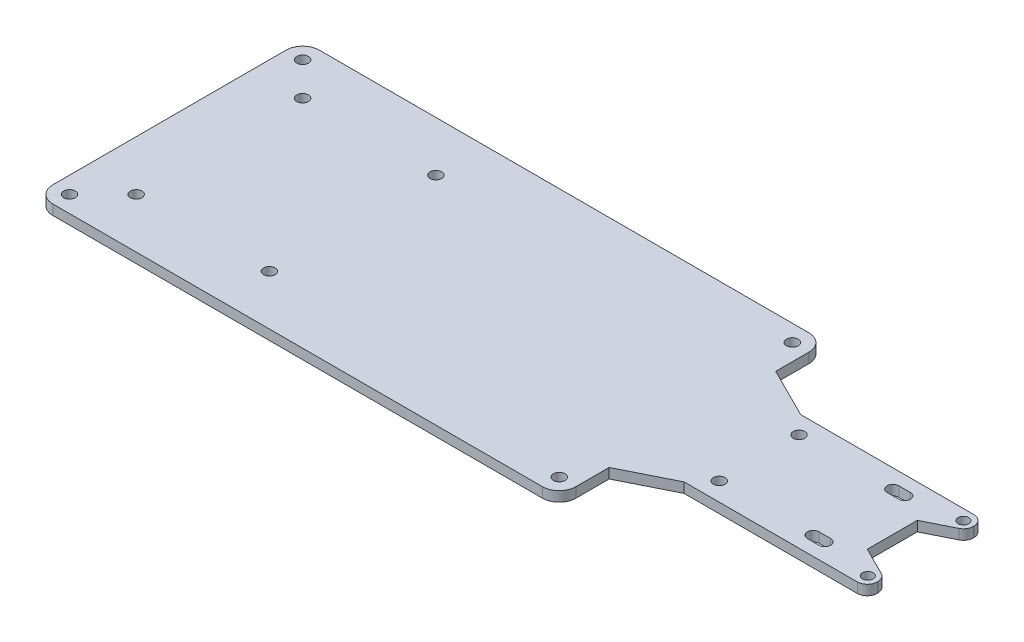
ISO-10303-21;
HEADER;
FILE_DESCRIPTION(('STEP AP214'),'2;1');
FILE_NAME('part.step','',(''),(''),'','','');
FILE_SCHEMA(('AUTOMOTIVE_DESIGN { 1 0 10303 214 1 1 1 1 }'));
ENDSEC;
DATA;
#1=APPLICATION_CONTEXT('core data for automotive mechanical design processes');
#2=APPLICATION_PROTOCOL_DEFINITION('international standard','automotive_design',2000,#1);
#3=PRODUCT_CONTEXT('',#1,'mechanical');
#4=PRODUCT('Part','Part','',(#3));
#5=PRODUCT_RELATED_PRODUCT_CATEGORY('part','',(#4));
#6=PRODUCT_DEFINITION_FORMATION('','',#4);
#7=PRODUCT_DEFINITION_CONTEXT('part definition',#1,'design');
#8=PRODUCT_DEFINITION('design','',#6,#7);
#9=PRODUCT_DEFINITION_SHAPE('','',#8);
#10=(LENGTH_UNIT() NAMED_UNIT(*) SI_UNIT(.MILLI.,.METRE.));
#11=(NAMED_UNIT(*) PLANE_ANGLE_UNIT() SI_UNIT($,.RADIAN.));
#12=(NAMED_UNIT(*) SI_UNIT($,.STERADIAN.) SOLID_ANGLE_UNIT());
#13=UNCERTAINTY_MEASURE_WITH_UNIT(LENGTH_MEASURE(1.E-05),#10,'distance_accuracy_value','');
#14=(GEOMETRIC_REPRESENTATION_CONTEXT(3) GLOBAL_UNCERTAINTY_ASSIGNED_CONTEXT((#13)) GLOBAL_UNIT_ASSIGNED_CONTEXT((#10,
#11,#12)) REPRESENTATION_CONTEXT('',''));
#15=CARTESIAN_POINT('',(0.,0.,0.));
#16=DIRECTION('',(0.,0.,1.));
#17=DIRECTION('',(1.,0.,0.));
#18=AXIS2_PLACEMENT_3D('',#15,#16,#17);
#19=CARTESIAN_POINT('',(224.,3.,-14.5));
#20=DIRECTION('',(0.,-1.,0.));
#21=DIRECTION('',(0.,0.,-1.));
#22=AXIS2_PLACEMENT_3D('',#19,#20,#21);
#23=PLANE('',#22);
#24=CARTESIAN_POINT('',(177.024019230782,3.,11.975));
#25=DIRECTION('',(0.,1.,0.));
#26=DIRECTION('',(0.,0.,1.));
#27=AXIS2_PLACEMENT_3D('',#24,#25,#26);
#28=CIRCLE('',#27,1.75000000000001);
#29=CARTESIAN_POINT('',(177.024019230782,3.,13.725));
#30=VERTEX_POINT('',#29);
#31=EDGE_CURVE('E269',#30,#30,#28,.T.);
#32=ORIENTED_EDGE('',*,*,#31,.F.);
#33=EDGE_LOOP('',(#32));
#34=FACE_BOUND('',#33,.T.);
#35=DIRECTION('',(1.,0.,0.));
#36=VECTOR('',#35,1.);
#37=CARTESIAN_POINT('',(205.225980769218,3.,-10.225));
#38=LINE('',#37,#36);
#39=CARTESIAN_POINT('',(205.225980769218,3.,-10.225));
#40=VERTEX_POINT('',#39);
#41=CARTESIAN_POINT('',(208.725980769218,3.,-10.225));
#42=VERTEX_POINT('',#41);
#43=EDGE_CURVE('E284',#40,#42,#38,.T.);
#44=ORIENTED_EDGE('',*,*,#43,.F.);
#45=CARTESIAN_POINT('',(205.225980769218,3.,-11.975));
#46=DIRECTION('',(0.,1.,0.));
#47=DIRECTION('',(0.,0.,1.));
#48=AXIS2_PLACEMENT_3D('',#45,#46,#47);
#49=CIRCLE('',#48,1.75);
#50=CARTESIAN_POINT('',(205.225980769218,3.,-13.725));
#51=VERTEX_POINT('',#50);
#52=EDGE_CURVE('E58',#51,#40,#49,.T.);
#53=ORIENTED_EDGE('',*,*,#52,.F.);
#54=DIRECTION('',(-1.,0.,0.));
#55=VECTOR('',#54,1.);
#56=CARTESIAN_POINT('',(205.225980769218,3.,-13.725));
#57=LINE('',#56,#55);
#58=CARTESIAN_POINT('',(208.725980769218,3.,-13.725));
#59=VERTEX_POINT('',#58);
#60=EDGE_CURVE('E275',#59,#51,#57,.T.);
#61=ORIENTED_EDGE('',*,*,#60,.F.);
#62=CARTESIAN_POINT('',(208.725980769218,3.,-11.975));
#63=DIRECTION('',(0.,1.,0.));
#64=DIRECTION('',(0.,0.,1.));
#65=AXIS2_PLACEMENT_3D('',#62,#63,#64);
#66=CIRCLE('',#65,1.75);
#67=EDGE_CURVE('E281',#42,#59,#66,.T.);
#68=ORIENTED_EDGE('',*,*,#67,.F.);
#69=EDGE_LOOP('',(#44,#53,#61,#68));
#70=FACE_BOUND('',#69,.T.);
#71=DIRECTION('',(1.,0.,0.));
#72=VECTOR('',#71,1.);
#73=CARTESIAN_POINT('',(205.225980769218,3.,13.725));
#74=LINE('',#73,#72);
#75=CARTESIAN_POINT('',(205.225980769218,3.,13.725));
#76=VERTEX_POINT('',#75);
#77=CARTESIAN_POINT('',(208.725980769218,3.,13.725));
#78=VERTEX_POINT('',#77);
#79=EDGE_CURVE('E261',#76,#78,#74,.T.);
#80=ORIENTED_EDGE('',*,*,#79,.F.);
#81=CARTESIAN_POINT('',(205.225980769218,3.,11.975));
#82=DIRECTION('',(0.,1.,0.));
#83=DIRECTION('',(0.,0.,1.));
#84=AXIS2_PLACEMENT_3D('',#81,#82,#83);
#85=CIRCLE('',#84,1.75);
#86=CARTESIAN_POINT('',(205.225980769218,3.,10.225));
#87=VERTEX_POINT('',#86);
#88=EDGE_CURVE('E66',#87,#76,#85,.T.);
#89=ORIENTED_EDGE('',*,*,#88,.F.);
#90=DIRECTION('',(-1.,0.,0.));
#91=VECTOR('',#90,1.);
#92=CARTESIAN_POINT('',(205.225980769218,3.,10.225));
#93=LINE('',#92,#91);
#94=CARTESIAN_POINT('',(208.725980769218,3.,10.225));
#95=VERTEX_POINT('',#94);
#96=EDGE_CURVE('E249',#95,#87,#93,.T.);
#97=ORIENTED_EDGE('',*,*,#96,.F.);
#98=CARTESIAN_POINT('',(208.725980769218,3.,11.975));
#99=DIRECTION('',(0.,1.,0.));
#100=DIRECTION('',(0.,0.,1.));
#101=AXIS2_PLACEMENT_3D('',#98,#99,#100);
#102=CIRCLE('',#101,1.75);
#103=EDGE_CURVE('E255',#78,#95,#102,.T.);
#104=ORIENTED_EDGE('',*,*,#103,.F.);
#105=EDGE_LOOP('',(#80,#89,#97,#104));
#106=FACE_BOUND('',#105,.T.);
#107=CARTESIAN_POINT('',(177.024019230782,3.,-11.975));
#108=DIRECTION('',(0.,1.,0.));
#109=DIRECTION('',(0.,0.,1.));
#110=AXIS2_PLACEMENT_3D('',#107,#108,#109);
#111=CIRCLE('',#110,1.75000000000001);
#112=CARTESIAN_POINT('',(177.024019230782,3.,-10.225));
#113=VERTEX_POINT('',#112);
#114=EDGE_CURVE('E272',#113,#113,#111,.T.);
#115=ORIENTED_EDGE('',*,*,#114,.F.);
#116=EDGE_LOOP('',(#115));
#117=FACE_BOUND('',#116,.T.);
#118=CARTESIAN_POINT('',(5.,3.,35.));
#119=DIRECTION('',(0.,1.,0.));
#120=DIRECTION('',(0.,0.,1.));
#121=AXIS2_PLACEMENT_3D('',#118,#119,#120);
#122=CIRCLE('',#121,1.75);
#123=CARTESIAN_POINT('',(5.,3.,36.75));
#124=VERTEX_POINT('',#123);
#125=EDGE_CURVE('E295',#124,#124,#122,.T.);
#126=ORIENTED_EDGE('',*,*,#125,.F.);
#127=EDGE_LOOP('',(#126));
#128=FACE_BOUND('',#127,.T.);
#129=CARTESIAN_POINT('',(152.,3.,-35.));
#130=DIRECTION('',(0.,1.,0.));
#131=DIRECTION('',(0.,0.,1.));
#132=AXIS2_PLACEMENT_3D('',#129,#130,#131);
#133=CIRCLE('',#132,1.75000000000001);
#134=CARTESIAN_POINT('',(152.,3.,-33.25));
#135=VERTEX_POINT('',#134);
#136=EDGE_CURVE('E294',#135,#135,#133,.T.);
#137=ORIENTED_EDGE('',*,*,#136,.F.);
#138=EDGE_LOOP('',(#137));
#139=FACE_BOUND('',#138,.T.);
#140=CARTESIAN_POINT('',(152.,3.,35.));
#141=DIRECTION('',(0.,1.,0.));
#142=DIRECTION('',(0.,0.,1.));
#143=AXIS2_PLACEMENT_3D('',#140,#141,#142);
#144=CIRCLE('',#143,1.75000000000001);
#145=CARTESIAN_POINT('',(152.,3.,36.75));
#146=VERTEX_POINT('',#145);
#147=EDGE_CURVE('E291',#146,#146,#144,.T.);
#148=ORIENTED_EDGE('',*,*,#147,.F.);
#149=EDGE_LOOP('',(#148));
#150=FACE_BOUND('',#149,.T.);
#151=CARTESIAN_POINT('',(5.,3.,-35.));
#152=DIRECTION('',(0.,1.,0.));
#153=DIRECTION('',(0.,0.,1.));
#154=AXIS2_PLACEMENT_3D('',#151,#152,#153);
#155=CIRCLE('',#154,1.75);
#156=CARTESIAN_POINT('',(5.,3.,-33.25));
#157=VERTEX_POINT('',#156);
#158=EDGE_CURVE('E298',#157,#157,#155,.T.);
#159=ORIENTED_EDGE('',*,*,#158,.F.);
#160=EDGE_LOOP('',(#159));
#161=FACE_BOUND('',#160,.T.);
#162=CARTESIAN_POINT('',(15.,3.,25.));
#163=DIRECTION('',(0.,-1.,0.));
#164=DIRECTION('',(0.,0.,-1.));
#165=AXIS2_PLACEMENT_3D('',#162,#163,#164);
#166=CIRCLE('',#165,1.75);
#167=CARTESIAN_POINT('',(15.,3.,23.25));
#168=VERTEX_POINT('',#167);
#169=EDGE_CURVE('E326',#168,#168,#166,.T.);
#170=ORIENTED_EDGE('',*,*,#169,.T.);
#171=EDGE_LOOP('',(#170));
#172=FACE_BOUND('',#171,.T.);
#173=CARTESIAN_POINT('',(55.,3.,25.));
#174=DIRECTION('',(0.,-1.,0.));
#175=DIRECTION('',(0.,0.,-1.));
#176=AXIS2_PLACEMENT_3D('',#173,#174,#175);
#177=CIRCLE('',#176,1.75);
#178=CARTESIAN_POINT('',(55.,3.,23.25));
#179=VERTEX_POINT('',#178);
#180=EDGE_CURVE('E323',#179,#179,#177,.T.);
#181=ORIENTED_EDGE('',*,*,#180,.T.);
#182=EDGE_LOOP('',(#181));
#183=FACE_BOUND('',#182,.T.);
#184=CARTESIAN_POINT('',(55.,3.,-25.));
#185=DIRECTION('',(0.,-1.,0.));
#186=DIRECTION('',(0.,0.,-1.));
#187=AXIS2_PLACEMENT_3D('',#184,#185,#186);
#188=CIRCLE('',#187,1.75);
#189=CARTESIAN_POINT('',(55.,3.,-26.75));
#190=VERTEX_POINT('',#189);
#191=EDGE_CURVE('E320',#190,#190,#188,.T.);
#192=ORIENTED_EDGE('',*,*,#191,.T.);
#193=EDGE_LOOP('',(#192));
#194=FACE_BOUND('',#193,.T.);
#195=CARTESIAN_POINT('',(15.,3.,-25.));
#196=DIRECTION('',(0.,-1.,0.));
#197=DIRECTION('',(0.,0.,-1.));
#198=AXIS2_PLACEMENT_3D('',#195,#196,#197);
#199=CIRCLE('',#198,1.75);
#200=CARTESIAN_POINT('',(15.,3.,-26.75));
#201=VERTEX_POINT('',#200);
#202=EDGE_CURVE('E317',#201,#201,#199,.T.);
#203=ORIENTED_EDGE('',*,*,#202,.T.);
#204=EDGE_LOOP('',(#203));
#205=FACE_BOUND('',#204,.T.);
#206=DIRECTION('',(1.,0.,0.));
#207=VECTOR('',#206,1.);
#208=CARTESIAN_POINT('',(0.,3.,40.));
#209=LINE('',#208,#207);
#210=CARTESIAN_POINT('',(5.,3.,40.));
#211=VERTEX_POINT('',#210);
#212=CARTESIAN_POINT('',(152.,3.,40.));
#213=VERTEX_POINT('',#212);
#214=EDGE_CURVE('E352',#211,#213,#209,.T.);
#215=ORIENTED_EDGE('',*,*,#214,.T.);
#216=CARTESIAN_POINT('',(152.,3.,35.));
#217=DIRECTION('',(0.,-1.,0.));
#218=DIRECTION('',(0.,0.,-1.));
#219=AXIS2_PLACEMENT_3D('',#216,#217,#218);
#220=CIRCLE('',#219,5.);
#221=CARTESIAN_POINT('',(157.,3.,35.));
#222=VERTEX_POINT('',#221);
#223=EDGE_CURVE('E485',#213,#222,#220,.F.);
#224=ORIENTED_EDGE('',*,*,#223,.T.);
#225=DIRECTION('',(0.,0.,-1.));
#226=VECTOR('',#225,1.);
#227=CARTESIAN_POINT('',(157.,3.,40.));
#228=LINE('',#227,#226);
#229=CARTESIAN_POINT('',(157.,3.,25.));
#230=VERTEX_POINT('',#229);
#231=EDGE_CURVE('E355',#222,#230,#228,.T.);
#232=ORIENTED_EDGE('',*,*,#231,.T.);
#233=DIRECTION('',(0.894427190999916,0.,-0.447213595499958));
#234=VECTOR('',#233,1.);
#235=CARTESIAN_POINT('',(157.,3.,25.));
#236=LINE('',#235,#234);
#237=CARTESIAN_POINT('',(172.,3.,17.5));
#238=VERTEX_POINT('',#237);
#239=EDGE_CURVE('E357',#230,#238,#236,.T.);
#240=ORIENTED_EDGE('',*,*,#239,.T.);
#241=DIRECTION('',(1.,0.,0.));
#242=VECTOR('',#241,1.);
#243=CARTESIAN_POINT('',(172.,3.,17.5));
#244=LINE('',#243,#242);
#245=CARTESIAN_POINT('',(224.,3.,17.5));
#246=VERTEX_POINT('',#245);
#247=EDGE_CURVE('E359',#238,#246,#244,.T.);
#248=ORIENTED_EDGE('',*,*,#247,.T.);
#249=CARTESIAN_POINT('',(224.,3.,14.5));
#250=DIRECTION('',(0.,1.,0.));
#251=DIRECTION('',(0.,0.,1.));
#252=AXIS2_PLACEMENT_3D('',#249,#250,#251);
#253=CIRCLE('',#252,3.);
#254=CARTESIAN_POINT('',(227.,3.,14.5));
#255=VERTEX_POINT('',#254);
#256=EDGE_CURVE('E361',#246,#255,#253,.T.);
#257=ORIENTED_EDGE('',*,*,#256,.T.);
#258=DIRECTION('',(0.,0.,-1.));
#259=VECTOR('',#258,1.);
#260=CARTESIAN_POINT('',(227.,3.,14.3541019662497));
#261=LINE('',#260,#259);
#262=CARTESIAN_POINT('',(227.,3.,14.3541019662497));
#263=VERTEX_POINT('',#262);
#264=EDGE_CURVE('E363',#255,#263,#261,.T.);
#265=ORIENTED_EDGE('',*,*,#264,.T.);
#266=CARTESIAN_POINT('',(224.,3.,14.3541019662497));
#267=DIRECTION('',(0.,1.,0.));
#268=DIRECTION('',(0.,0.,-1.));
#269=AXIS2_PLACEMENT_3D('',#266,#267,#268);
#270=CIRCLE('',#269,3.);
#271=CARTESIAN_POINT('',(225.3416407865,3.,11.6708203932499));
#272=VERTEX_POINT('',#271);
#273=EDGE_CURVE('E365',#263,#272,#270,.T.);
#274=ORIENTED_EDGE('',*,*,#273,.T.);
#275=DIRECTION('',(-0.894427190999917,0.,-0.447213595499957));
#276=VECTOR('',#275,1.);
#277=CARTESIAN_POINT('',(217.,3.,7.5));
#278=LINE('',#277,#276);
#279=CARTESIAN_POINT('',(217.,3.,7.5));
#280=VERTEX_POINT('',#279);
#281=EDGE_CURVE('E367',#272,#280,#278,.T.);
#282=ORIENTED_EDGE('',*,*,#281,.T.);
#283=DIRECTION('',(0.,0.,-1.));
#284=VECTOR('',#283,1.);
#285=CARTESIAN_POINT('',(217.,3.,-7.5));
#286=LINE('',#285,#284);
#287=CARTESIAN_POINT('',(217.,3.,-7.5));
#288=VERTEX_POINT('',#287);
#289=EDGE_CURVE('E369',#280,#288,#286,.T.);
#290=ORIENTED_EDGE('',*,*,#289,.T.);
#291=DIRECTION('',(0.894427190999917,0.,-0.447213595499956));
#292=VECTOR('',#291,1.);
#293=CARTESIAN_POINT('',(217.,3.,-7.5));
#294=LINE('',#293,#292);
#295=CARTESIAN_POINT('',(225.3416407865,3.,-11.6708203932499));
#296=VERTEX_POINT('',#295);
#297=EDGE_CURVE('E371',#288,#296,#294,.T.);
#298=ORIENTED_EDGE('',*,*,#297,.T.);
#299=CARTESIAN_POINT('',(224.,3.,-14.3541019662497));
#300=DIRECTION('',(0.,1.,0.));
#301=DIRECTION('',(0.,0.,1.));
#302=AXIS2_PLACEMENT_3D('',#299,#300,#301);
#303=CIRCLE('',#302,3.00000000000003);
#304=CARTESIAN_POINT('',(227.,3.,-14.3541019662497));
#305=VERTEX_POINT('',#304);
#306=EDGE_CURVE('E373',#296,#305,#303,.T.);
#307=ORIENTED_EDGE('',*,*,#306,.T.);
#308=DIRECTION('',(-3.80479090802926E-13,0.,-1.));
#309=VECTOR('',#308,1.);
#310=CARTESIAN_POINT('',(227.,3.,-14.3541019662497));
#311=LINE('',#310,#309);
#312=CARTESIAN_POINT('',(227.,3.,-14.5));
#313=VERTEX_POINT('',#312);
#314=EDGE_CURVE('E375',#305,#313,#311,.T.);
#315=ORIENTED_EDGE('',*,*,#314,.T.);
#316=CARTESIAN_POINT('',(224.,3.,-14.5));
#317=DIRECTION('',(0.,1.,0.));
#318=DIRECTION('',(0.,0.,-1.));
#319=AXIS2_PLACEMENT_3D('',#316,#317,#318);
#320=CIRCLE('',#319,3.);
#321=CARTESIAN_POINT('',(224.,3.,-17.5));
#322=VERTEX_POINT('',#321);
#323=EDGE_CURVE('E377',#313,#322,#320,.T.);
#324=ORIENTED_EDGE('',*,*,#323,.T.);
#325=DIRECTION('',(-1.,0.,0.));
#326=VECTOR('',#325,1.);
#327=CARTESIAN_POINT('',(172.,3.,-17.5));
#328=LINE('',#327,#326);
#329=CARTESIAN_POINT('',(172.,3.,-17.5));
#330=VERTEX_POINT('',#329);
#331=EDGE_CURVE('E379',#322,#330,#328,.T.);
#332=ORIENTED_EDGE('',*,*,#331,.T.);
#333=DIRECTION('',(-0.894427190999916,0.,-0.447213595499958));
#334=VECTOR('',#333,1.);
#335=CARTESIAN_POINT('',(157.,3.,-25.));
#336=LINE('',#335,#334);
#337=CARTESIAN_POINT('',(157.,3.,-25.));
#338=VERTEX_POINT('',#337);
#339=EDGE_CURVE('E381',#330,#338,#336,.T.);
#340=ORIENTED_EDGE('',*,*,#339,.T.);
#341=DIRECTION('',(0.,0.,-1.));
#342=VECTOR('',#341,1.);
#343=CARTESIAN_POINT('',(157.,3.,-40.));
#344=LINE('',#343,#342);
#345=CARTESIAN_POINT('',(157.,3.,-35.));
#346=VERTEX_POINT('',#345);
#347=EDGE_CURVE('E342',#338,#346,#344,.T.);
#348=ORIENTED_EDGE('',*,*,#347,.T.);
#349=CARTESIAN_POINT('',(152.,3.,-35.));
#350=DIRECTION('',(0.,-1.,0.));
#351=DIRECTION('',(0.,0.,-1.));
#352=AXIS2_PLACEMENT_3D('',#349,#350,#351);
#353=CIRCLE('',#352,5.);
#354=CARTESIAN_POINT('',(152.,3.,-40.));
#355=VERTEX_POINT('',#354);
#356=EDGE_CURVE('E483',#346,#355,#353,.F.);
#357=ORIENTED_EDGE('',*,*,#356,.T.);
#358=DIRECTION('',(-1.,0.,0.));
#359=VECTOR('',#358,1.);
#360=CARTESIAN_POINT('',(77.,3.,-40.));
#361=LINE('',#360,#359);
#362=CARTESIAN_POINT('',(5.,3.,-40.));
#363=VERTEX_POINT('',#362);
#364=EDGE_CURVE('E345',#355,#363,#361,.T.);
#365=ORIENTED_EDGE('',*,*,#364,.T.);
#366=CARTESIAN_POINT('',(5.,3.,-35.));
#367=DIRECTION('',(0.,-1.,0.));
#368=DIRECTION('',(0.,0.,-1.));
#369=AXIS2_PLACEMENT_3D('',#366,#367,#368);
#370=CIRCLE('',#369,5.);
#371=CARTESIAN_POINT('',(0.,3.,-35.));
#372=VERTEX_POINT('',#371);
#373=EDGE_CURVE('E479',#363,#372,#370,.F.);
#374=ORIENTED_EDGE('',*,*,#373,.T.);
#375=DIRECTION('',(0.,0.,1.));
#376=VECTOR('',#375,1.);
#377=CARTESIAN_POINT('',(0.,3.,-40.));
#378=LINE('',#377,#376);
#379=CARTESIAN_POINT('',(0.,3.,35.));
#380=VERTEX_POINT('',#379);
#381=EDGE_CURVE('E349',#372,#380,#378,.T.);
#382=ORIENTED_EDGE('',*,*,#381,.T.);
#383=CARTESIAN_POINT('',(5.,3.,35.));
#384=DIRECTION('',(0.,-1.,0.));
#385=DIRECTION('',(0.,0.,-1.));
#386=AXIS2_PLACEMENT_3D('',#383,#384,#385);
#387=CIRCLE('',#386,5.);
#388=EDGE_CURVE('E481',#380,#211,#387,.F.);
#389=ORIENTED_EDGE('',*,*,#388,.T.);
#390=EDGE_LOOP('',(#215,#224,#232,#240,#248,#257,#265,#274,#282,#290,#298,#307,#315,#324,#332,
#340,#348,#357,#365,#374,#382,#389));
#391=FACE_BOUND('',#390,.T.);
#392=CARTESIAN_POINT('',(224.,3.,-14.3541019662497));
#393=DIRECTION('',(0.,1.,0.));
#394=DIRECTION('',(0.,0.,1.));
#395=AXIS2_PLACEMENT_3D('',#392,#393,#394);
#396=CIRCLE('',#395,1.59999999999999);
#397=CARTESIAN_POINT('',(224.,3.,-12.7541019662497));
#398=VERTEX_POINT('',#397);
#399=EDGE_CURVE('E336',#398,#398,#396,.T.);
#400=ORIENTED_EDGE('',*,*,#399,.F.);
#401=EDGE_LOOP('',(#400));
#402=FACE_BOUND('',#401,.T.);
#403=CARTESIAN_POINT('',(224.,3.,14.3541019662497));
#404=DIRECTION('',(0.,1.,0.));
#405=DIRECTION('',(0.,0.,-1.));
#406=AXIS2_PLACEMENT_3D('',#403,#404,#405);
#407=CIRCLE('',#406,1.59999999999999);
#408=CARTESIAN_POINT('',(224.,3.,12.7541019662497));
#409=VERTEX_POINT('',#408);
#410=EDGE_CURVE('E330',#409,#409,#407,.T.);
#411=ORIENTED_EDGE('',*,*,#410,.F.);
#412=EDGE_LOOP('',(#411));
#413=FACE_BOUND('',#412,.T.);
#414=ADVANCED_FACE('F42',(#34,#70,#106,#117,#128,#139,#150,#161,#172,#183,#194,#205,#391,#402,
#413),#23,.F.);
#415=CARTESIAN_POINT('',(224.,0.,-14.5));
#416=DIRECTION('',(0.,-1.,0.));
#417=DIRECTION('',(0.,0.,-1.));
#418=AXIS2_PLACEMENT_3D('',#415,#416,#417);
#419=PLANE('',#418);
#420=CARTESIAN_POINT('',(177.024019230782,0.,11.975));
#421=DIRECTION('',(0.,-1.,0.));
#422=DIRECTION('',(0.,0.,-1.));
#423=AXIS2_PLACEMENT_3D('',#420,#421,#422);
#424=CIRCLE('',#423,1.75000000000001);
#425=CARTESIAN_POINT('',(177.024019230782,0.,10.225));
#426=VERTEX_POINT('',#425);
#427=EDGE_CURVE('E46',#426,#426,#424,.T.);
#428=ORIENTED_EDGE('',*,*,#427,.F.);
#429=EDGE_LOOP('',(#428));
#430=FACE_BOUND('',#429,.T.);
#431=CARTESIAN_POINT('',(205.225980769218,0.,-11.975));
#432=DIRECTION('',(0.,-1.,0.));
#433=DIRECTION('',(0.,0.,-1.));
#434=AXIS2_PLACEMENT_3D('',#431,#432,#433);
#435=CIRCLE('',#434,1.75);
#436=CARTESIAN_POINT('',(205.225980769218,0.,-10.225));
#437=VERTEX_POINT('',#436);
#438=CARTESIAN_POINT('',(205.225980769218,0.,-13.725));
#439=VERTEX_POINT('',#438);
#440=EDGE_CURVE('E11',#437,#439,#435,.T.);
#441=ORIENTED_EDGE('',*,*,#440,.F.);
#442=DIRECTION('',(-1.,0.,0.));
#443=VECTOR('',#442,1.);
#444=CARTESIAN_POINT('',(224.,0.,-10.225));
#445=LINE('',#444,#443);
#446=CARTESIAN_POINT('',(208.725980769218,0.,-10.225));
#447=VERTEX_POINT('',#446);
#448=EDGE_CURVE('E519',#447,#437,#445,.T.);
#449=ORIENTED_EDGE('',*,*,#448,.F.);
#450=CARTESIAN_POINT('',(208.725980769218,0.,-11.975));
#451=DIRECTION('',(0.,-1.,0.));
#452=DIRECTION('',(0.,0.,-1.));
#453=AXIS2_PLACEMENT_3D('',#450,#451,#452);
#454=CIRCLE('',#453,1.75);
#455=CARTESIAN_POINT('',(208.725980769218,0.,-13.725));
#456=VERTEX_POINT('',#455);
#457=EDGE_CURVE('E521',#456,#447,#454,.T.);
#458=ORIENTED_EDGE('',*,*,#457,.F.);
#459=DIRECTION('',(1.,0.,0.));
#460=VECTOR('',#459,1.);
#461=CARTESIAN_POINT('',(224.,0.,-13.725));
#462=LINE('',#461,#460);
#463=EDGE_CURVE('E51',#439,#456,#462,.T.);
#464=ORIENTED_EDGE('',*,*,#463,.F.);
#465=EDGE_LOOP('',(#441,#449,#458,#464));
#466=FACE_BOUND('',#465,.T.);
#467=CARTESIAN_POINT('',(205.225980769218,0.,11.975));
#468=DIRECTION('',(0.,-1.,0.));
#469=DIRECTION('',(0.,0.,-1.));
#470=AXIS2_PLACEMENT_3D('',#467,#468,#469);
#471=CIRCLE('',#470,1.75);
#472=CARTESIAN_POINT('',(205.225980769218,0.,13.725));
#473=VERTEX_POINT('',#472);
#474=CARTESIAN_POINT('',(205.225980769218,0.,10.225));
#475=VERTEX_POINT('',#474);
#476=EDGE_CURVE('E243',#473,#475,#471,.T.);
#477=ORIENTED_EDGE('',*,*,#476,.F.);
#478=DIRECTION('',(-1.,0.,0.));
#479=VECTOR('',#478,1.);
#480=CARTESIAN_POINT('',(224.,0.,13.725));
#481=LINE('',#480,#479);
#482=CARTESIAN_POINT('',(208.725980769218,0.,13.725));
#483=VERTEX_POINT('',#482);
#484=EDGE_CURVE('E499',#483,#473,#481,.T.);
#485=ORIENTED_EDGE('',*,*,#484,.F.);
#486=CARTESIAN_POINT('',(208.725980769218,0.,11.975));
#487=DIRECTION('',(0.,-1.,0.));
#488=DIRECTION('',(0.,0.,-1.));
#489=AXIS2_PLACEMENT_3D('',#486,#487,#488);
#490=CIRCLE('',#489,1.75);
#491=CARTESIAN_POINT('',(208.725980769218,0.,10.225));
#492=VERTEX_POINT('',#491);
#493=EDGE_CURVE('E513',#492,#483,#490,.T.);
#494=ORIENTED_EDGE('',*,*,#493,.F.);
#495=DIRECTION('',(1.,0.,0.));
#496=VECTOR('',#495,1.);
#497=CARTESIAN_POINT('',(224.,0.,10.225));
#498=LINE('',#497,#496);
#499=EDGE_CURVE('E516',#475,#492,#498,.T.);
#500=ORIENTED_EDGE('',*,*,#499,.F.);
#501=EDGE_LOOP('',(#477,#485,#494,#500));
#502=FACE_BOUND('',#501,.T.);
#503=CARTESIAN_POINT('',(177.024019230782,0.,-11.975));
#504=DIRECTION('',(0.,-1.,0.));
#505=DIRECTION('',(0.,0.,-1.));
#506=AXIS2_PLACEMENT_3D('',#503,#504,#505);
#507=CIRCLE('',#506,1.75000000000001);
#508=CARTESIAN_POINT('',(177.024019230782,0.,-13.725));
#509=VERTEX_POINT('',#508);
#510=EDGE_CURVE('E290',#509,#509,#507,.T.);
#511=ORIENTED_EDGE('',*,*,#510,.F.);
#512=EDGE_LOOP('',(#511));
#513=FACE_BOUND('',#512,.T.);
#514=CARTESIAN_POINT('',(5.,0.,35.));
#515=DIRECTION('',(0.,-1.,0.));
#516=DIRECTION('',(0.,0.,-1.));
#517=AXIS2_PLACEMENT_3D('',#514,#515,#516);
#518=CIRCLE('',#517,1.75);
#519=CARTESIAN_POINT('',(5.,0.,33.25));
#520=VERTEX_POINT('',#519);
#521=EDGE_CURVE('E314',#520,#520,#518,.T.);
#522=ORIENTED_EDGE('',*,*,#521,.F.);
#523=EDGE_LOOP('',(#522));
#524=FACE_BOUND('',#523,.T.);
#525=CARTESIAN_POINT('',(152.,0.,-35.));
#526=DIRECTION('',(0.,-1.,0.));
#527=DIRECTION('',(0.,0.,-1.));
#528=AXIS2_PLACEMENT_3D('',#525,#526,#527);
#529=CIRCLE('',#528,1.75000000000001);
#530=CARTESIAN_POINT('',(152.,0.,-36.75));
#531=VERTEX_POINT('',#530);
#532=EDGE_CURVE('E505',#531,#531,#529,.T.);
#533=ORIENTED_EDGE('',*,*,#532,.F.);
#534=EDGE_LOOP('',(#533));
#535=FACE_BOUND('',#534,.T.);
#536=CARTESIAN_POINT('',(152.,0.,35.));
#537=DIRECTION('',(0.,-1.,0.));
#538=DIRECTION('',(0.,0.,-1.));
#539=AXIS2_PLACEMENT_3D('',#536,#537,#538);
#540=CIRCLE('',#539,1.75000000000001);
#541=CARTESIAN_POINT('',(152.,0.,33.25));
#542=VERTEX_POINT('',#541);
#543=EDGE_CURVE('E502',#542,#542,#540,.T.);
#544=ORIENTED_EDGE('',*,*,#543,.F.);
#545=EDGE_LOOP('',(#544));
#546=FACE_BOUND('',#545,.T.);
#547=CARTESIAN_POINT('',(5.,0.,-35.));
#548=DIRECTION('',(0.,-1.,0.));
#549=DIRECTION('',(0.,0.,-1.));
#550=AXIS2_PLACEMENT_3D('',#547,#548,#549);
#551=CIRCLE('',#550,1.75);
#552=CARTESIAN_POINT('',(5.,0.,-36.75));
#553=VERTEX_POINT('',#552);
#554=EDGE_CURVE('E303',#553,#553,#551,.T.);
#555=ORIENTED_EDGE('',*,*,#554,.F.);
#556=EDGE_LOOP('',(#555));
#557=FACE_BOUND('',#556,.T.);
#558=CARTESIAN_POINT('',(15.,0.,25.));
#559=DIRECTION('',(0.,1.,0.));
#560=DIRECTION('',(0.,0.,1.));
#561=AXIS2_PLACEMENT_3D('',#558,#559,#560);
#562=CIRCLE('',#561,1.75);
#563=CARTESIAN_POINT('',(15.,0.,26.75));
#564=VERTEX_POINT('',#563);
#565=EDGE_CURVE('E311',#564,#564,#562,.T.);
#566=ORIENTED_EDGE('',*,*,#565,.T.);
#567=EDGE_LOOP('',(#566));
#568=FACE_BOUND('',#567,.T.);
#569=CARTESIAN_POINT('',(55.,0.,25.));
#570=DIRECTION('',(0.,1.,0.));
#571=DIRECTION('',(0.,0.,1.));
#572=AXIS2_PLACEMENT_3D('',#569,#570,#571);
#573=CIRCLE('',#572,1.75);
#574=CARTESIAN_POINT('',(55.,0.,26.75));
#575=VERTEX_POINT('',#574);
#576=EDGE_CURVE('E308',#575,#575,#573,.T.);
#577=ORIENTED_EDGE('',*,*,#576,.T.);
#578=EDGE_LOOP('',(#577));
#579=FACE_BOUND('',#578,.T.);
#580=CARTESIAN_POINT('',(55.,0.,-25.));
#581=DIRECTION('',(0.,1.,0.));
#582=DIRECTION('',(0.,0.,1.));
#583=AXIS2_PLACEMENT_3D('',#580,#581,#582);
#584=CIRCLE('',#583,1.75);
#585=CARTESIAN_POINT('',(55.,0.,-23.25));
#586=VERTEX_POINT('',#585);
#587=EDGE_CURVE('E304',#586,#586,#584,.T.);
#588=ORIENTED_EDGE('',*,*,#587,.T.);
#589=EDGE_LOOP('',(#588));
#590=FACE_BOUND('',#589,.T.);
#591=CARTESIAN_POINT('',(15.,0.,-25.));
#592=DIRECTION('',(0.,1.,0.));
#593=DIRECTION('',(0.,0.,1.));
#594=AXIS2_PLACEMENT_3D('',#591,#592,#593);
#595=CIRCLE('',#594,1.75);
#596=CARTESIAN_POINT('',(15.,0.,-23.25));
#597=VERTEX_POINT('',#596);
#598=EDGE_CURVE('E307',#597,#597,#595,.T.);
#599=ORIENTED_EDGE('',*,*,#598,.T.);
#600=EDGE_LOOP('',(#599));
#601=FACE_BOUND('',#600,.T.);
#602=CARTESIAN_POINT('',(224.,0.,-14.3541019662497));
#603=DIRECTION('',(0.,1.,0.));
#604=DIRECTION('',(0.,0.,1.));
#605=AXIS2_PLACEMENT_3D('',#602,#603,#604);
#606=CIRCLE('',#605,1.59999999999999);
#607=CARTESIAN_POINT('',(224.,0.,-12.7541019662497));
#608=VERTEX_POINT('',#607);
#609=EDGE_CURVE('E333',#608,#608,#606,.T.);
#610=ORIENTED_EDGE('',*,*,#609,.T.);
#611=EDGE_LOOP('',(#610));
#612=FACE_BOUND('',#611,.T.);
#613=DIRECTION('',(0.,0.,-1.));
#614=VECTOR('',#613,1.);
#615=CARTESIAN_POINT('',(157.,0.,40.));
#616=LINE('',#615,#614);
#617=CARTESIAN_POINT('',(157.,0.,35.));
#618=VERTEX_POINT('',#617);
#619=CARTESIAN_POINT('',(157.,0.,25.));
#620=VERTEX_POINT('',#619);
#621=EDGE_CURVE('E395',#618,#620,#616,.T.);
#622=ORIENTED_EDGE('',*,*,#621,.F.);
#623=CARTESIAN_POINT('',(152.,0.,35.));
#624=DIRECTION('',(0.,-1.,0.));
#625=DIRECTION('',(0.,0.,-1.));
#626=AXIS2_PLACEMENT_3D('',#623,#624,#625);
#627=CIRCLE('',#626,5.);
#628=CARTESIAN_POINT('',(152.,0.,40.));
#629=VERTEX_POINT('',#628);
#630=EDGE_CURVE('E472',#618,#629,#627,.T.);
#631=ORIENTED_EDGE('',*,*,#630,.T.);
#632=DIRECTION('',(1.,0.,0.));
#633=VECTOR('',#632,1.);
#634=CARTESIAN_POINT('',(77.,0.,40.));
#635=LINE('',#634,#633);
#636=CARTESIAN_POINT('',(5.,0.,40.));
#637=VERTEX_POINT('',#636);
#638=EDGE_CURVE('E392',#637,#629,#635,.T.);
#639=ORIENTED_EDGE('',*,*,#638,.F.);
#640=CARTESIAN_POINT('',(5.,0.,35.));
#641=DIRECTION('',(0.,-1.,0.));
#642=DIRECTION('',(0.,0.,-1.));
#643=AXIS2_PLACEMENT_3D('',#640,#641,#642);
#644=CIRCLE('',#643,5.);
#645=CARTESIAN_POINT('',(0.,0.,35.));
#646=VERTEX_POINT('',#645);
#647=EDGE_CURVE('E468',#637,#646,#644,.T.);
#648=ORIENTED_EDGE('',*,*,#647,.T.);
#649=DIRECTION('',(0.,0.,1.));
#650=VECTOR('',#649,1.);
#651=CARTESIAN_POINT('',(0.,0.,30.));
#652=LINE('',#651,#650);
#653=CARTESIAN_POINT('',(0.,0.,-35.));
#654=VERTEX_POINT('',#653);
#655=EDGE_CURVE('E389',#654,#646,#652,.T.);
#656=ORIENTED_EDGE('',*,*,#655,.F.);
#657=CARTESIAN_POINT('',(5.,0.,-35.));
#658=DIRECTION('',(0.,-1.,0.));
#659=DIRECTION('',(0.,0.,-1.));
#660=AXIS2_PLACEMENT_3D('',#657,#658,#659);
#661=CIRCLE('',#660,5.);
#662=CARTESIAN_POINT('',(5.,0.,-40.));
#663=VERTEX_POINT('',#662);
#664=EDGE_CURVE('E466',#654,#663,#661,.T.);
#665=ORIENTED_EDGE('',*,*,#664,.T.);
#666=DIRECTION('',(-1.,0.,0.));
#667=VECTOR('',#666,1.);
#668=CARTESIAN_POINT('',(77.,0.,-40.));
#669=LINE('',#668,#667);
#670=CARTESIAN_POINT('',(152.,0.,-40.));
#671=VERTEX_POINT('',#670);
#672=EDGE_CURVE('E386',#671,#663,#669,.T.);
#673=ORIENTED_EDGE('',*,*,#672,.F.);
#674=CARTESIAN_POINT('',(152.,0.,-35.));
#675=DIRECTION('',(0.,-1.,0.));
#676=DIRECTION('',(0.,0.,-1.));
#677=AXIS2_PLACEMENT_3D('',#674,#675,#676);
#678=CIRCLE('',#677,5.);
#679=CARTESIAN_POINT('',(157.,0.,-35.));
#680=VERTEX_POINT('',#679);
#681=EDGE_CURVE('E470',#671,#680,#678,.T.);
#682=ORIENTED_EDGE('',*,*,#681,.T.);
#683=DIRECTION('',(0.,0.,-1.));
#684=VECTOR('',#683,1.);
#685=CARTESIAN_POINT('',(157.,0.,-40.));
#686=LINE('',#685,#684);
#687=CARTESIAN_POINT('',(157.,0.,-25.));
#688=VERTEX_POINT('',#687);
#689=EDGE_CURVE('E339',#688,#680,#686,.T.);
#690=ORIENTED_EDGE('',*,*,#689,.F.);
#691=DIRECTION('',(-0.894427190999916,0.,-0.447213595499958));
#692=VECTOR('',#691,1.);
#693=CARTESIAN_POINT('',(157.,0.,-25.));
#694=LINE('',#693,#692);
#695=CARTESIAN_POINT('',(172.,0.,-17.5));
#696=VERTEX_POINT('',#695);
#697=EDGE_CURVE('E346',#696,#688,#694,.T.);
#698=ORIENTED_EDGE('',*,*,#697,.F.);
#699=DIRECTION('',(-1.,0.,0.));
#700=VECTOR('',#699,1.);
#701=CARTESIAN_POINT('',(172.,0.,-17.5));
#702=LINE('',#701,#700);
#703=CARTESIAN_POINT('',(224.,0.,-17.5));
#704=VERTEX_POINT('',#703);
#705=EDGE_CURVE('E419',#704,#696,#702,.T.);
#706=ORIENTED_EDGE('',*,*,#705,.F.);
#707=CARTESIAN_POINT('',(224.,0.,-14.5));
#708=DIRECTION('',(0.,1.,0.));
#709=DIRECTION('',(0.,0.,-1.));
#710=AXIS2_PLACEMENT_3D('',#707,#708,#709);
#711=CIRCLE('',#710,3.);
#712=CARTESIAN_POINT('',(227.,0.,-14.5));
#713=VERTEX_POINT('',#712);
#714=EDGE_CURVE('E417',#713,#704,#711,.T.);
#715=ORIENTED_EDGE('',*,*,#714,.F.);
#716=DIRECTION('',(-3.80479090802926E-13,0.,-1.));
#717=VECTOR('',#716,1.);
#718=CARTESIAN_POINT('',(227.,0.,-14.3541019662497));
#719=LINE('',#718,#717);
#720=CARTESIAN_POINT('',(227.,0.,-14.3541019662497));
#721=VERTEX_POINT('',#720);
#722=EDGE_CURVE('E415',#721,#713,#719,.T.);
#723=ORIENTED_EDGE('',*,*,#722,.F.);
#724=CARTESIAN_POINT('',(224.,0.,-14.3541019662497));
#725=DIRECTION('',(0.,1.,0.));
#726=DIRECTION('',(0.,0.,1.));
#727=AXIS2_PLACEMENT_3D('',#724,#725,#726);
#728=CIRCLE('',#727,3.00000000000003);
#729=CARTESIAN_POINT('',(225.3416407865,0.,-11.6708203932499));
#730=VERTEX_POINT('',#729);
#731=EDGE_CURVE('E413',#730,#721,#728,.T.);
#732=ORIENTED_EDGE('',*,*,#731,.F.);
#733=DIRECTION('',(0.894427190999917,0.,-0.447213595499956));
#734=VECTOR('',#733,1.);
#735=CARTESIAN_POINT('',(217.,0.,-7.5));
#736=LINE('',#735,#734);
#737=CARTESIAN_POINT('',(217.,0.,-7.5));
#738=VERTEX_POINT('',#737);
#739=EDGE_CURVE('E411',#738,#730,#736,.T.);
#740=ORIENTED_EDGE('',*,*,#739,.F.);
#741=DIRECTION('',(0.,0.,-1.));
#742=VECTOR('',#741,1.);
#743=CARTESIAN_POINT('',(217.,0.,-7.5));
#744=LINE('',#743,#742);
#745=CARTESIAN_POINT('',(217.,0.,7.5));
#746=VERTEX_POINT('',#745);
#747=EDGE_CURVE('E409',#746,#738,#744,.T.);
#748=ORIENTED_EDGE('',*,*,#747,.F.);
#749=DIRECTION('',(-0.894427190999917,0.,-0.447213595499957));
#750=VECTOR('',#749,1.);
#751=CARTESIAN_POINT('',(217.,0.,7.5));
#752=LINE('',#751,#750);
#753=CARTESIAN_POINT('',(225.3416407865,0.,11.6708203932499));
#754=VERTEX_POINT('',#753);
#755=EDGE_CURVE('E407',#754,#746,#752,.T.);
#756=ORIENTED_EDGE('',*,*,#755,.F.);
#757=CARTESIAN_POINT('',(224.,0.,14.3541019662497));
#758=DIRECTION('',(0.,1.,0.));
#759=DIRECTION('',(0.,0.,-1.));
#760=AXIS2_PLACEMENT_3D('',#757,#758,#759);
#761=CIRCLE('',#760,3.);
#762=CARTESIAN_POINT('',(227.,0.,14.3541019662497));
#763=VERTEX_POINT('',#762);
#764=EDGE_CURVE('E405',#763,#754,#761,.T.);
#765=ORIENTED_EDGE('',*,*,#764,.F.);
#766=DIRECTION('',(0.,0.,-1.));
#767=VECTOR('',#766,1.);
#768=CARTESIAN_POINT('',(227.,0.,14.3541019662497));
#769=LINE('',#768,#767);
#770=CARTESIAN_POINT('',(227.,0.,14.5));
#771=VERTEX_POINT('',#770);
#772=EDGE_CURVE('E403',#771,#763,#769,.T.);
#773=ORIENTED_EDGE('',*,*,#772,.F.);
#774=CARTESIAN_POINT('',(224.,0.,14.5));
#775=DIRECTION('',(0.,1.,0.));
#776=DIRECTION('',(0.,0.,1.));
#777=AXIS2_PLACEMENT_3D('',#774,#775,#776);
#778=CIRCLE('',#777,3.);
#779=CARTESIAN_POINT('',(224.,0.,17.5));
#780=VERTEX_POINT('',#779);
#781=EDGE_CURVE('E401',#780,#771,#778,.T.);
#782=ORIENTED_EDGE('',*,*,#781,.F.);
#783=DIRECTION('',(1.,0.,0.));
#784=VECTOR('',#783,1.);
#785=CARTESIAN_POINT('',(172.,0.,17.5));
#786=LINE('',#785,#784);
#787=CARTESIAN_POINT('',(172.,0.,17.5));
#788=VERTEX_POINT('',#787);
#789=EDGE_CURVE('E399',#788,#780,#786,.T.);
#790=ORIENTED_EDGE('',*,*,#789,.F.);
#791=DIRECTION('',(0.894427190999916,0.,-0.447213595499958));
#792=VECTOR('',#791,1.);
#793=CARTESIAN_POINT('',(157.,0.,25.));
#794=LINE('',#793,#792);
#795=EDGE_CURVE('E397',#620,#788,#794,.T.);
#796=ORIENTED_EDGE('',*,*,#795,.F.);
#797=EDGE_LOOP('',(#622,#631,#639,#648,#656,#665,#673,#682,#690,#698,#706,#715,#723,#732,#740,
#748,#756,#765,#773,#782,#790,#796));
#798=FACE_BOUND('',#797,.T.);
#799=CARTESIAN_POINT('',(224.,0.,14.3541019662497));
#800=DIRECTION('',(0.,1.,0.));
#801=DIRECTION('',(0.,0.,-1.));
#802=AXIS2_PLACEMENT_3D('',#799,#800,#801);
#803=CIRCLE('',#802,1.59999999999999);
#804=CARTESIAN_POINT('',(224.,0.,12.7541019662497));
#805=VERTEX_POINT('',#804);
#806=EDGE_CURVE('E329',#805,#805,#803,.T.);
#807=ORIENTED_EDGE('',*,*,#806,.T.);
#808=EDGE_LOOP('',(#807));
#809=FACE_BOUND('',#808,.T.);
#810=ADVANCED_FACE('F537',(#430,#466,#502,#513,#524,#535,#546,#557,#568,#579,#590,#601,#612,
#798,#809),#419,.T.);
#811=CARTESIAN_POINT('',(157.,3.,-40.));
#812=DIRECTION('',(-1.,0.,0.));
#813=DIRECTION('',(0.,0.,1.));
#814=AXIS2_PLACEMENT_3D('',#811,#812,#813);
#815=PLANE('',#814);
#816=ORIENTED_EDGE('',*,*,#689,.T.);
#817=DIRECTION('',(0.,-1.,0.));
#818=VECTOR('',#817,1.);
#819=CARTESIAN_POINT('',(157.,3.,-35.));
#820=LINE('',#819,#818);
#821=EDGE_CURVE('E492',#680,#346,#820,.F.);
#822=ORIENTED_EDGE('',*,*,#821,.T.);
#823=ORIENTED_EDGE('',*,*,#347,.F.);
#824=DIRECTION('',(0.,-1.,0.));
#825=VECTOR('',#824,1.);
#826=CARTESIAN_POINT('',(157.,3.,-25.));
#827=LINE('',#826,#825);
#828=EDGE_CURVE('E383',#338,#688,#827,.T.);
#829=ORIENTED_EDGE('',*,*,#828,.T.);
#830=EDGE_LOOP('',(#816,#822,#823,#829));
#831=FACE_BOUND('',#830,.T.);
#832=ADVANCED_FACE('F551',(#831),#815,.F.);
#833=CARTESIAN_POINT('',(77.,3.,-40.));
#834=DIRECTION('',(0.,0.,1.));
#835=DIRECTION('',(1.,0.,0.));
#836=AXIS2_PLACEMENT_3D('',#833,#834,#835);
#837=PLANE('',#836);
#838=ORIENTED_EDGE('',*,*,#364,.F.);
#839=DIRECTION('',(0.,-1.,0.));
#840=VECTOR('',#839,1.);
#841=CARTESIAN_POINT('',(152.,3.,-40.));
#842=LINE('',#841,#840);
#843=EDGE_CURVE('E489',#355,#671,#842,.T.);
#844=ORIENTED_EDGE('',*,*,#843,.T.);
#845=ORIENTED_EDGE('',*,*,#672,.T.);
#846=DIRECTION('',(0.,-1.,0.));
#847=VECTOR('',#846,1.);
#848=CARTESIAN_POINT('',(5.,3.,-40.));
#849=LINE('',#848,#847);
#850=EDGE_CURVE('E487',#663,#363,#849,.F.);
#851=ORIENTED_EDGE('',*,*,#850,.T.);
#852=EDGE_LOOP('',(#838,#844,#845,#851));
#853=FACE_BOUND('',#852,.T.);
#854=ADVANCED_FACE('F622',(#853),#837,.F.);
#855=CARTESIAN_POINT('',(0.,3.,30.));
#856=DIRECTION('',(1.,0.,0.));
#857=DIRECTION('',(0.,0.,-1.));
#858=AXIS2_PLACEMENT_3D('',#855,#856,#857);
#859=PLANE('',#858);
#860=ORIENTED_EDGE('',*,*,#655,.T.);
#861=DIRECTION('',(0.,-1.,0.));
#862=VECTOR('',#861,1.);
#863=CARTESIAN_POINT('',(0.,3.,35.));
#864=LINE('',#863,#862);
#865=EDGE_CURVE('E497',#646,#380,#864,.F.);
#866=ORIENTED_EDGE('',*,*,#865,.T.);
#867=ORIENTED_EDGE('',*,*,#381,.F.);
#868=DIRECTION('',(0.,-1.,0.));
#869=VECTOR('',#868,1.);
#870=CARTESIAN_POINT('',(0.,3.,-35.));
#871=LINE('',#870,#869);
#872=EDGE_CURVE('E494',#372,#654,#871,.T.);
#873=ORIENTED_EDGE('',*,*,#872,.T.);
#874=EDGE_LOOP('',(#860,#866,#867,#873));
#875=FACE_BOUND('',#874,.T.);
#876=ADVANCED_FACE('F618',(#875),#859,.F.);
#877=CARTESIAN_POINT('',(77.,3.,40.));
#878=DIRECTION('',(0.,0.,-1.));
#879=DIRECTION('',(-1.,0.,0.));
#880=AXIS2_PLACEMENT_3D('',#877,#878,#879);
#881=PLANE('',#880);
#882=ORIENTED_EDGE('',*,*,#638,.T.);
#883=DIRECTION('',(0.,-1.,0.));
#884=VECTOR('',#883,1.);
#885=CARTESIAN_POINT('',(152.,3.,40.));
#886=LINE('',#885,#884);
#887=EDGE_CURVE('E477',#629,#213,#886,.F.);
#888=ORIENTED_EDGE('',*,*,#887,.T.);
#889=ORIENTED_EDGE('',*,*,#214,.F.);
#890=DIRECTION('',(0.,-1.,0.));
#891=VECTOR('',#890,1.);
#892=CARTESIAN_POINT('',(5.,3.,40.));
#893=LINE('',#892,#891);
#894=EDGE_CURVE('E474',#211,#637,#893,.T.);
#895=ORIENTED_EDGE('',*,*,#894,.T.);
#896=EDGE_LOOP('',(#882,#888,#889,#895));
#897=FACE_BOUND('',#896,.T.);
#898=ADVANCED_FACE('F614',(#897),#881,.F.);
#899=CARTESIAN_POINT('',(157.,3.,40.));
#900=DIRECTION('',(-1.,0.,0.));
#901=DIRECTION('',(0.,0.,1.));
#902=AXIS2_PLACEMENT_3D('',#899,#900,#901);
#903=PLANE('',#902);
#904=ORIENTED_EDGE('',*,*,#231,.F.);
#905=DIRECTION('',(0.,-1.,0.));
#906=VECTOR('',#905,1.);
#907=CARTESIAN_POINT('',(157.,3.,35.));
#908=LINE('',#907,#906);
#909=EDGE_CURVE('E463',#222,#618,#908,.T.);
#910=ORIENTED_EDGE('',*,*,#909,.T.);
#911=ORIENTED_EDGE('',*,*,#621,.T.);
#912=DIRECTION('',(0.,-1.,0.));
#913=VECTOR('',#912,1.);
#914=CARTESIAN_POINT('',(157.,3.,25.));
#915=LINE('',#914,#913);
#916=EDGE_CURVE('E460',#230,#620,#915,.T.);
#917=ORIENTED_EDGE('',*,*,#916,.F.);
#918=EDGE_LOOP('',(#904,#910,#911,#917));
#919=FACE_BOUND('',#918,.T.);
#920=ADVANCED_FACE('F610',(#919),#903,.F.);
#921=CARTESIAN_POINT('',(157.,3.,25.));
#922=DIRECTION('',(-0.447213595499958,0.,-0.894427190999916));
#923=DIRECTION('',(-0.894427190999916,0.,0.447213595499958));
#924=AXIS2_PLACEMENT_3D('',#921,#922,#923);
#925=PLANE('',#924);
#926=ORIENTED_EDGE('',*,*,#795,.T.);
#927=DIRECTION('',(0.,-1.,0.));
#928=VECTOR('',#927,1.);
#929=CARTESIAN_POINT('',(172.,3.,17.5));
#930=LINE('',#929,#928);
#931=EDGE_CURVE('E457',#238,#788,#930,.T.);
#932=ORIENTED_EDGE('',*,*,#931,.F.);
#933=ORIENTED_EDGE('',*,*,#239,.F.);
#934=ORIENTED_EDGE('',*,*,#916,.T.);
#935=EDGE_LOOP('',(#926,#932,#933,#934));
#936=FACE_BOUND('',#935,.T.);
#937=ADVANCED_FACE('F606',(#936),#925,.F.);
#938=CARTESIAN_POINT('',(172.,3.,17.5));
#939=DIRECTION('',(0.,0.,-1.));
#940=DIRECTION('',(-1.,0.,0.));
#941=AXIS2_PLACEMENT_3D('',#938,#939,#940);
#942=PLANE('',#941);
#943=ORIENTED_EDGE('',*,*,#789,.T.);
#944=DIRECTION('',(0.,-1.,0.));
#945=VECTOR('',#944,1.);
#946=CARTESIAN_POINT('',(224.,3.,17.5));
#947=LINE('',#946,#945);
#948=EDGE_CURVE('E454',#246,#780,#947,.T.);
#949=ORIENTED_EDGE('',*,*,#948,.F.);
#950=ORIENTED_EDGE('',*,*,#247,.F.);
#951=ORIENTED_EDGE('',*,*,#931,.T.);
#952=EDGE_LOOP('',(#943,#949,#950,#951));
#953=FACE_BOUND('',#952,.T.);
#954=ADVANCED_FACE('F602',(#953),#942,.F.);
#955=CARTESIAN_POINT('',(224.,3.,14.5));
#956=DIRECTION('',(0.,-1.,0.));
#957=DIRECTION('',(0.,0.,-1.));
#958=AXIS2_PLACEMENT_3D('',#955,#956,#957);
#959=CYLINDRICAL_SURFACE('',#958,3.);
#960=ORIENTED_EDGE('',*,*,#781,.T.);
#961=DIRECTION('',(0.,-1.,0.));
#962=VECTOR('',#961,1.);
#963=CARTESIAN_POINT('',(227.,3.,14.5));
#964=LINE('',#963,#962);
#965=EDGE_CURVE('E451',#255,#771,#964,.T.);
#966=ORIENTED_EDGE('',*,*,#965,.F.);
#967=ORIENTED_EDGE('',*,*,#256,.F.);
#968=ORIENTED_EDGE('',*,*,#948,.T.);
#969=EDGE_LOOP('',(#960,#966,#967,#968));
#970=FACE_BOUND('',#969,.T.);
#971=ADVANCED_FACE('F598',(#970),#959,.T.);
#972=CARTESIAN_POINT('',(227.,3.,14.3541019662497));
#973=DIRECTION('',(-1.,0.,0.));
#974=DIRECTION('',(0.,0.,1.));
#975=AXIS2_PLACEMENT_3D('',#972,#973,#974);
#976=PLANE('',#975);
#977=ORIENTED_EDGE('',*,*,#772,.T.);
#978=DIRECTION('',(0.,-1.,0.));
#979=VECTOR('',#978,1.);
#980=CARTESIAN_POINT('',(227.,3.,14.3541019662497));
#981=LINE('',#980,#979);
#982=EDGE_CURVE('E448',#263,#763,#981,.T.);
#983=ORIENTED_EDGE('',*,*,#982,.F.);
#984=ORIENTED_EDGE('',*,*,#264,.F.);
#985=ORIENTED_EDGE('',*,*,#965,.T.);
#986=EDGE_LOOP('',(#977,#983,#984,#985));
#987=FACE_BOUND('',#986,.T.);
#988=ADVANCED_FACE('F594',(#987),#976,.F.);
#989=CARTESIAN_POINT('',(224.,3.,14.3541019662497));
#990=DIRECTION('',(0.,-1.,0.));
#991=DIRECTION('',(0.,0.,-1.));
#992=AXIS2_PLACEMENT_3D('',#989,#990,#991);
#993=CYLINDRICAL_SURFACE('',#992,3.);
#994=ORIENTED_EDGE('',*,*,#764,.T.);
#995=DIRECTION('',(0.,-1.,0.));
#996=VECTOR('',#995,1.);
#997=CARTESIAN_POINT('',(225.3416407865,3.,11.6708203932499));
#998=LINE('',#997,#996);
#999=EDGE_CURVE('E445',#272,#754,#998,.T.);
#1000=ORIENTED_EDGE('',*,*,#999,.F.);
#1001=ORIENTED_EDGE('',*,*,#273,.F.);
#1002=ORIENTED_EDGE('',*,*,#982,.T.);
#1003=EDGE_LOOP('',(#994,#1000,#1001,#1002));
#1004=FACE_BOUND('',#1003,.T.);
#1005=ADVANCED_FACE('F590',(#1004),#993,.T.);
#1006=CARTESIAN_POINT('',(217.,3.,7.5));
#1007=DIRECTION('',(-0.447213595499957,0.,0.894427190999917));
#1008=DIRECTION('',(0.894427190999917,0.,0.447213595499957));
#1009=AXIS2_PLACEMENT_3D('',#1006,#1007,#1008);
#1010=PLANE('',#1009);
#1011=ORIENTED_EDGE('',*,*,#755,.T.);
#1012=DIRECTION('',(0.,-1.,0.));
#1013=VECTOR('',#1012,1.);
#1014=CARTESIAN_POINT('',(217.,3.,7.5));
#1015=LINE('',#1014,#1013);
#1016=EDGE_CURVE('E442',#280,#746,#1015,.T.);
#1017=ORIENTED_EDGE('',*,*,#1016,.F.);
#1018=ORIENTED_EDGE('',*,*,#281,.F.);
#1019=ORIENTED_EDGE('',*,*,#999,.T.);
#1020=EDGE_LOOP('',(#1011,#1017,#1018,#1019));
#1021=FACE_BOUND('',#1020,.T.);
#1022=ADVANCED_FACE('F586',(#1021),#1010,.F.);
#1023=CARTESIAN_POINT('',(217.,3.,-7.5));
#1024=DIRECTION('',(-1.,0.,0.));
#1025=DIRECTION('',(0.,0.,1.));
#1026=AXIS2_PLACEMENT_3D('',#1023,#1024,#1025);
#1027=PLANE('',#1026);
#1028=ORIENTED_EDGE('',*,*,#747,.T.);
#1029=DIRECTION('',(0.,-1.,0.));
#1030=VECTOR('',#1029,1.);
#1031=CARTESIAN_POINT('',(217.,3.,-7.5));
#1032=LINE('',#1031,#1030);
#1033=EDGE_CURVE('E439',#288,#738,#1032,.T.);
#1034=ORIENTED_EDGE('',*,*,#1033,.F.);
#1035=ORIENTED_EDGE('',*,*,#289,.F.);
#1036=ORIENTED_EDGE('',*,*,#1016,.T.);
#1037=EDGE_LOOP('',(#1028,#1034,#1035,#1036));
#1038=FACE_BOUND('',#1037,.T.);
#1039=ADVANCED_FACE('F582',(#1038),#1027,.F.);
#1040=CARTESIAN_POINT('',(217.,3.,-7.5));
#1041=DIRECTION('',(-0.447213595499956,0.,-0.894427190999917));
#1042=DIRECTION('',(-0.894427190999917,0.,0.447213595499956));
#1043=AXIS2_PLACEMENT_3D('',#1040,#1041,#1042);
#1044=PLANE('',#1043);
#1045=ORIENTED_EDGE('',*,*,#739,.T.);
#1046=DIRECTION('',(0.,-1.,0.));
#1047=VECTOR('',#1046,1.);
#1048=CARTESIAN_POINT('',(225.3416407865,3.,-11.6708203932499));
#1049=LINE('',#1048,#1047);
#1050=EDGE_CURVE('E436',#296,#730,#1049,.T.);
#1051=ORIENTED_EDGE('',*,*,#1050,.F.);
#1052=ORIENTED_EDGE('',*,*,#297,.F.);
#1053=ORIENTED_EDGE('',*,*,#1033,.T.);
#1054=EDGE_LOOP('',(#1045,#1051,#1052,#1053));
#1055=FACE_BOUND('',#1054,.T.);
#1056=ADVANCED_FACE('F578',(#1055),#1044,.F.);
#1057=CARTESIAN_POINT('',(224.,3.,-14.3541019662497));
#1058=DIRECTION('',(0.,-1.,0.));
#1059=DIRECTION('',(0.,0.,-1.));
#1060=AXIS2_PLACEMENT_3D('',#1057,#1058,#1059);
#1061=CYLINDRICAL_SURFACE('',#1060,3.00000000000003);
#1062=ORIENTED_EDGE('',*,*,#731,.T.);
#1063=DIRECTION('',(0.,-1.,0.));
#1064=VECTOR('',#1063,1.);
#1065=CARTESIAN_POINT('',(227.,3.,-14.3541019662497));
#1066=LINE('',#1065,#1064);
#1067=EDGE_CURVE('E433',#305,#721,#1066,.T.);
#1068=ORIENTED_EDGE('',*,*,#1067,.F.);
#1069=ORIENTED_EDGE('',*,*,#306,.F.);
#1070=ORIENTED_EDGE('',*,*,#1050,.T.);
#1071=EDGE_LOOP('',(#1062,#1068,#1069,#1070));
#1072=FACE_BOUND('',#1071,.T.);
#1073=ADVANCED_FACE('F574',(#1072),#1061,.T.);
#1074=CARTESIAN_POINT('',(227.,3.,-14.3541019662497));
#1075=DIRECTION('',(-1.,0.,3.80479090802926E-13));
#1076=DIRECTION('',(3.80479090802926E-13,0.,1.));
#1077=AXIS2_PLACEMENT_3D('',#1074,#1075,#1076);
#1078=PLANE('',#1077);
#1079=ORIENTED_EDGE('',*,*,#722,.T.);
#1080=DIRECTION('',(0.,-1.,0.));
#1081=VECTOR('',#1080,1.);
#1082=CARTESIAN_POINT('',(227.,3.,-14.5));
#1083=LINE('',#1082,#1081);
#1084=EDGE_CURVE('E430',#313,#713,#1083,.T.);
#1085=ORIENTED_EDGE('',*,*,#1084,.F.);
#1086=ORIENTED_EDGE('',*,*,#314,.F.);
#1087=ORIENTED_EDGE('',*,*,#1067,.T.);
#1088=EDGE_LOOP('',(#1079,#1085,#1086,#1087));
#1089=FACE_BOUND('',#1088,.T.);
#1090=ADVANCED_FACE('F570',(#1089),#1078,.F.);
#1091=CARTESIAN_POINT('',(224.,3.,-14.5));
#1092=DIRECTION('',(0.,-1.,0.));
#1093=DIRECTION('',(0.,0.,-1.));
#1094=AXIS2_PLACEMENT_3D('',#1091,#1092,#1093);
#1095=CYLINDRICAL_SURFACE('',#1094,3.);
#1096=ORIENTED_EDGE('',*,*,#714,.T.);
#1097=DIRECTION('',(0.,-1.,0.));
#1098=VECTOR('',#1097,1.);
#1099=CARTESIAN_POINT('',(224.,3.,-17.5));
#1100=LINE('',#1099,#1098);
#1101=EDGE_CURVE('E427',#322,#704,#1100,.T.);
#1102=ORIENTED_EDGE('',*,*,#1101,.F.);
#1103=ORIENTED_EDGE('',*,*,#323,.F.);
#1104=ORIENTED_EDGE('',*,*,#1084,.T.);
#1105=EDGE_LOOP('',(#1096,#1102,#1103,#1104));
#1106=FACE_BOUND('',#1105,.T.);
#1107=ADVANCED_FACE('F566',(#1106),#1095,.T.);
#1108=CARTESIAN_POINT('',(172.,3.,-17.5));
#1109=DIRECTION('',(0.,0.,1.));
#1110=DIRECTION('',(1.,0.,0.));
#1111=AXIS2_PLACEMENT_3D('',#1108,#1109,#1110);
#1112=PLANE('',#1111);
#1113=ORIENTED_EDGE('',*,*,#705,.T.);
#1114=DIRECTION('',(0.,-1.,0.));
#1115=VECTOR('',#1114,1.);
#1116=CARTESIAN_POINT('',(172.,3.,-17.5));
#1117=LINE('',#1116,#1115);
#1118=EDGE_CURVE('E424',#330,#696,#1117,.T.);
#1119=ORIENTED_EDGE('',*,*,#1118,.F.);
#1120=ORIENTED_EDGE('',*,*,#331,.F.);
#1121=ORIENTED_EDGE('',*,*,#1101,.T.);
#1122=EDGE_LOOP('',(#1113,#1119,#1120,#1121));
#1123=FACE_BOUND('',#1122,.T.);
#1124=ADVANCED_FACE('F562',(#1123),#1112,.F.);
#1125=CARTESIAN_POINT('',(157.,3.,-25.));
#1126=DIRECTION('',(-0.447213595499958,0.,0.894427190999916));
#1127=DIRECTION('',(0.894427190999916,0.,0.447213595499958));
#1128=AXIS2_PLACEMENT_3D('',#1125,#1126,#1127);
#1129=PLANE('',#1128);
#1130=ORIENTED_EDGE('',*,*,#697,.T.);
#1131=ORIENTED_EDGE('',*,*,#828,.F.);
#1132=ORIENTED_EDGE('',*,*,#339,.F.);
#1133=ORIENTED_EDGE('',*,*,#1118,.T.);
#1134=EDGE_LOOP('',(#1130,#1131,#1132,#1133));
#1135=FACE_BOUND('',#1134,.T.);
#1136=ADVANCED_FACE('F559',(#1135),#1129,.F.);
#1137=CARTESIAN_POINT('',(224.,3.,-14.3541019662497));
#1138=DIRECTION('',(0.,-1.,0.));
#1139=DIRECTION('',(0.,0.,-1.));
#1140=AXIS2_PLACEMENT_3D('',#1137,#1138,#1139);
#1141=CYLINDRICAL_SURFACE('',#1140,1.59999999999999);
#1142=ORIENTED_EDGE('',*,*,#399,.T.);
#1143=EDGE_LOOP('',(#1142));
#1144=FACE_BOUND('',#1143,.T.);
#1145=ORIENTED_EDGE('',*,*,#609,.F.);
#1146=EDGE_LOOP('',(#1145));
#1147=FACE_BOUND('',#1146,.T.);
#1148=ADVANCED_FACE('F556',(#1144,#1147),#1141,.F.);
#1149=CARTESIAN_POINT('',(224.,3.,14.3541019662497));
#1150=DIRECTION('',(0.,-1.,0.));
#1151=DIRECTION('',(0.,0.,-1.));
#1152=AXIS2_PLACEMENT_3D('',#1149,#1150,#1151);
#1153=CYLINDRICAL_SURFACE('',#1152,1.59999999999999);
#1154=ORIENTED_EDGE('',*,*,#410,.T.);
#1155=EDGE_LOOP('',(#1154));
#1156=FACE_BOUND('',#1155,.T.);
#1157=ORIENTED_EDGE('',*,*,#806,.F.);
#1158=EDGE_LOOP('',(#1157));
#1159=FACE_BOUND('',#1158,.T.);
#1160=ADVANCED_FACE('F634',(#1156,#1159),#1153,.F.);
#1161=CARTESIAN_POINT('',(152.,3.,35.));
#1162=DIRECTION('',(0.,-1.,0.));
#1163=DIRECTION('',(0.,0.,-1.));
#1164=AXIS2_PLACEMENT_3D('',#1161,#1162,#1163);
#1165=CYLINDRICAL_SURFACE('',#1164,5.);
#1166=ORIENTED_EDGE('',*,*,#223,.F.);
#1167=ORIENTED_EDGE('',*,*,#887,.F.);
#1168=ORIENTED_EDGE('',*,*,#630,.F.);
#1169=ORIENTED_EDGE('',*,*,#909,.F.);
#1170=EDGE_LOOP('',(#1166,#1167,#1168,#1169));
#1171=FACE_BOUND('',#1170,.T.);
#1172=ADVANCED_FACE('F630',(#1171),#1165,.T.);
#1173=CARTESIAN_POINT('',(152.,3.,-35.));
#1174=DIRECTION('',(0.,-1.,0.));
#1175=DIRECTION('',(0.,0.,-1.));
#1176=AXIS2_PLACEMENT_3D('',#1173,#1174,#1175);
#1177=CYLINDRICAL_SURFACE('',#1176,5.);
#1178=ORIENTED_EDGE('',*,*,#356,.F.);
#1179=ORIENTED_EDGE('',*,*,#821,.F.);
#1180=ORIENTED_EDGE('',*,*,#681,.F.);
#1181=ORIENTED_EDGE('',*,*,#843,.F.);
#1182=EDGE_LOOP('',(#1178,#1179,#1180,#1181));
#1183=FACE_BOUND('',#1182,.T.);
#1184=ADVANCED_FACE('F633',(#1183),#1177,.T.);
#1185=CARTESIAN_POINT('',(5.,3.,35.));
#1186=DIRECTION('',(0.,-1.,0.));
#1187=DIRECTION('',(0.,0.,-1.));
#1188=AXIS2_PLACEMENT_3D('',#1185,#1186,#1187);
#1189=CYLINDRICAL_SURFACE('',#1188,5.);
#1190=ORIENTED_EDGE('',*,*,#388,.F.);
#1191=ORIENTED_EDGE('',*,*,#865,.F.);
#1192=ORIENTED_EDGE('',*,*,#647,.F.);
#1193=ORIENTED_EDGE('',*,*,#894,.F.);
#1194=EDGE_LOOP('',(#1190,#1191,#1192,#1193));
#1195=FACE_BOUND('',#1194,.T.);
#1196=ADVANCED_FACE('F637',(#1195),#1189,.T.);
#1197=CARTESIAN_POINT('',(5.,3.,-35.));
#1198=DIRECTION('',(0.,-1.,0.));
#1199=DIRECTION('',(0.,0.,-1.));
#1200=AXIS2_PLACEMENT_3D('',#1197,#1198,#1199);
#1201=CYLINDRICAL_SURFACE('',#1200,5.);
#1202=ORIENTED_EDGE('',*,*,#373,.F.);
#1203=ORIENTED_EDGE('',*,*,#850,.F.);
#1204=ORIENTED_EDGE('',*,*,#664,.F.);
#1205=ORIENTED_EDGE('',*,*,#872,.F.);
#1206=EDGE_LOOP('',(#1202,#1203,#1204,#1205));
#1207=FACE_BOUND('',#1206,.T.);
#1208=ADVANCED_FACE('F44',(#1207),#1201,.T.);
#1209=CARTESIAN_POINT('',(15.,0.,-25.));
#1210=DIRECTION('',(0.,1.,0.));
#1211=DIRECTION('',(0.,0.,1.));
#1212=AXIS2_PLACEMENT_3D('',#1209,#1210,#1211);
#1213=CYLINDRICAL_SURFACE('',#1212,1.75);
#1214=ORIENTED_EDGE('',*,*,#598,.F.);
#1215=EDGE_LOOP('',(#1214));
#1216=FACE_BOUND('',#1215,.T.);
#1217=ORIENTED_EDGE('',*,*,#202,.F.);
#1218=EDGE_LOOP('',(#1217));
#1219=FACE_BOUND('',#1218,.T.);
#1220=ADVANCED_FACE('F644',(#1216,#1219),#1213,.F.);
#1221=CARTESIAN_POINT('',(55.,0.,-25.));
#1222=DIRECTION('',(0.,1.,0.));
#1223=DIRECTION('',(0.,0.,1.));
#1224=AXIS2_PLACEMENT_3D('',#1221,#1222,#1223);
#1225=CYLINDRICAL_SURFACE('',#1224,1.75);
#1226=ORIENTED_EDGE('',*,*,#587,.F.);
#1227=EDGE_LOOP('',(#1226));
#1228=FACE_BOUND('',#1227,.T.);
#1229=ORIENTED_EDGE('',*,*,#191,.F.);
#1230=EDGE_LOOP('',(#1229));
#1231=FACE_BOUND('',#1230,.T.);
#1232=ADVANCED_FACE('F723',(#1228,#1231),#1225,.F.);
#1233=CARTESIAN_POINT('',(55.,0.,25.));
#1234=DIRECTION('',(0.,1.,0.));
#1235=DIRECTION('',(0.,0.,1.));
#1236=AXIS2_PLACEMENT_3D('',#1233,#1234,#1235);
#1237=CYLINDRICAL_SURFACE('',#1236,1.75);
#1238=ORIENTED_EDGE('',*,*,#576,.F.);
#1239=EDGE_LOOP('',(#1238));
#1240=FACE_BOUND('',#1239,.T.);
#1241=ORIENTED_EDGE('',*,*,#180,.F.);
#1242=EDGE_LOOP('',(#1241));
#1243=FACE_BOUND('',#1242,.T.);
#1244=ADVANCED_FACE('F729',(#1240,#1243),#1237,.F.);
#1245=CARTESIAN_POINT('',(15.,0.,25.));
#1246=DIRECTION('',(0.,1.,0.));
#1247=DIRECTION('',(0.,0.,1.));
#1248=AXIS2_PLACEMENT_3D('',#1245,#1246,#1247);
#1249=CYLINDRICAL_SURFACE('',#1248,1.75);
#1250=ORIENTED_EDGE('',*,*,#565,.F.);
#1251=EDGE_LOOP('',(#1250));
#1252=FACE_BOUND('',#1251,.T.);
#1253=ORIENTED_EDGE('',*,*,#169,.F.);
#1254=EDGE_LOOP('',(#1253));
#1255=FACE_BOUND('',#1254,.T.);
#1256=ADVANCED_FACE('F725',(#1252,#1255),#1249,.F.);
#1257=CARTESIAN_POINT('',(5.,-7.,-35.));
#1258=DIRECTION('',(0.,1.,0.));
#1259=DIRECTION('',(0.,0.,1.));
#1260=AXIS2_PLACEMENT_3D('',#1257,#1258,#1259);
#1261=CYLINDRICAL_SURFACE('',#1260,1.75);
#1262=ORIENTED_EDGE('',*,*,#554,.T.);
#1263=EDGE_LOOP('',(#1262));
#1264=FACE_BOUND('',#1263,.T.);
#1265=ORIENTED_EDGE('',*,*,#158,.T.);
#1266=EDGE_LOOP('',(#1265));
#1267=FACE_BOUND('',#1266,.T.);
#1268=ADVANCED_FACE('F728',(#1264,#1267),#1261,.F.);
#1269=CARTESIAN_POINT('',(152.,-7.,35.));
#1270=DIRECTION('',(0.,1.,0.));
#1271=DIRECTION('',(0.,0.,1.));
#1272=AXIS2_PLACEMENT_3D('',#1269,#1270,#1271);
#1273=CYLINDRICAL_SURFACE('',#1272,1.75000000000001);
#1274=ORIENTED_EDGE('',*,*,#543,.T.);
#1275=EDGE_LOOP('',(#1274));
#1276=FACE_BOUND('',#1275,.T.);
#1277=ORIENTED_EDGE('',*,*,#147,.T.);
#1278=EDGE_LOOP('',(#1277));
#1279=FACE_BOUND('',#1278,.T.);
#1280=ADVANCED_FACE('F739',(#1276,#1279),#1273,.F.);
#1281=CARTESIAN_POINT('',(152.,-7.,-35.));
#1282=DIRECTION('',(0.,1.,0.));
#1283=DIRECTION('',(0.,0.,1.));
#1284=AXIS2_PLACEMENT_3D('',#1281,#1282,#1283);
#1285=CYLINDRICAL_SURFACE('',#1284,1.75000000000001);
#1286=ORIENTED_EDGE('',*,*,#532,.T.);
#1287=EDGE_LOOP('',(#1286));
#1288=FACE_BOUND('',#1287,.T.);
#1289=ORIENTED_EDGE('',*,*,#136,.T.);
#1290=EDGE_LOOP('',(#1289));
#1291=FACE_BOUND('',#1290,.T.);
#1292=ADVANCED_FACE('F741',(#1288,#1291),#1285,.F.);
#1293=CARTESIAN_POINT('',(5.,-7.,35.));
#1294=DIRECTION('',(0.,1.,0.));
#1295=DIRECTION('',(0.,0.,1.));
#1296=AXIS2_PLACEMENT_3D('',#1293,#1294,#1295);
#1297=CYLINDRICAL_SURFACE('',#1296,1.75);
#1298=ORIENTED_EDGE('',*,*,#521,.T.);
#1299=EDGE_LOOP('',(#1298));
#1300=FACE_BOUND('',#1299,.T.);
#1301=ORIENTED_EDGE('',*,*,#125,.T.);
#1302=EDGE_LOOP('',(#1301));
#1303=FACE_BOUND('',#1302,.T.);
#1304=ADVANCED_FACE('F744',(#1300,#1303),#1297,.F.);
#1305=CARTESIAN_POINT('',(177.024019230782,-7.,-11.975));
#1306=DIRECTION('',(0.,1.,0.));
#1307=DIRECTION('',(0.,0.,1.));
#1308=AXIS2_PLACEMENT_3D('',#1305,#1306,#1307);
#1309=CYLINDRICAL_SURFACE('',#1308,1.75000000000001);
#1310=ORIENTED_EDGE('',*,*,#510,.T.);
#1311=EDGE_LOOP('',(#1310));
#1312=FACE_BOUND('',#1311,.T.);
#1313=ORIENTED_EDGE('',*,*,#114,.T.);
#1314=EDGE_LOOP('',(#1313));
#1315=FACE_BOUND('',#1314,.T.);
#1316=ADVANCED_FACE('F748',(#1312,#1315),#1309,.F.);
#1317=CARTESIAN_POINT('',(205.225980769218,-7.,11.975));
#1318=DIRECTION('',(0.,1.,0.));
#1319=DIRECTION('',(0.,0.,1.));
#1320=AXIS2_PLACEMENT_3D('',#1317,#1318,#1319);
#1321=CYLINDRICAL_SURFACE('',#1320,1.75);
#1322=ORIENTED_EDGE('',*,*,#476,.T.);
#1323=DIRECTION('',(0.,1.,0.));
#1324=VECTOR('',#1323,1.);
#1325=CARTESIAN_POINT('',(205.225980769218,-7.,10.225));
#1326=LINE('',#1325,#1324);
#1327=EDGE_CURVE('E239',#475,#87,#1326,.T.);
#1328=ORIENTED_EDGE('',*,*,#1327,.T.);
#1329=ORIENTED_EDGE('',*,*,#88,.T.);
#1330=DIRECTION('',(0.,1.,0.));
#1331=VECTOR('',#1330,1.);
#1332=CARTESIAN_POINT('',(205.225980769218,-7.,13.725));
#1333=LINE('',#1332,#1331);
#1334=EDGE_CURVE('E256',#473,#76,#1333,.T.);
#1335=ORIENTED_EDGE('',*,*,#1334,.F.);
#1336=EDGE_LOOP('',(#1322,#1328,#1329,#1335));
#1337=FACE_BOUND('',#1336,.T.);
#1338=ADVANCED_FACE('F241',(#1337),#1321,.F.);
#1339=CARTESIAN_POINT('',(205.225980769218,-7.,10.225));
#1340=DIRECTION('',(0.,0.,-1.));
#1341=DIRECTION('',(-1.,0.,0.));
#1342=AXIS2_PLACEMENT_3D('',#1339,#1340,#1341);
#1343=PLANE('',#1342);
#1344=ORIENTED_EDGE('',*,*,#499,.T.);
#1345=DIRECTION('',(0.,1.,0.));
#1346=VECTOR('',#1345,1.);
#1347=CARTESIAN_POINT('',(208.725980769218,-7.,10.225));
#1348=LINE('',#1347,#1346);
#1349=EDGE_CURVE('E246',#492,#95,#1348,.T.);
#1350=ORIENTED_EDGE('',*,*,#1349,.T.);
#1351=ORIENTED_EDGE('',*,*,#96,.T.);
#1352=ORIENTED_EDGE('',*,*,#1327,.F.);
#1353=EDGE_LOOP('',(#1344,#1350,#1351,#1352));
#1354=FACE_BOUND('',#1353,.T.);
#1355=ADVANCED_FACE('F250',(#1354),#1343,.F.);
#1356=CARTESIAN_POINT('',(208.725980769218,-7.,11.975));
#1357=DIRECTION('',(0.,1.,0.));
#1358=DIRECTION('',(0.,0.,1.));
#1359=AXIS2_PLACEMENT_3D('',#1356,#1357,#1358);
#1360=CYLINDRICAL_SURFACE('',#1359,1.75);
#1361=ORIENTED_EDGE('',*,*,#493,.T.);
#1362=DIRECTION('',(0.,1.,0.));
#1363=VECTOR('',#1362,1.);
#1364=CARTESIAN_POINT('',(208.725980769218,-7.,13.725));
#1365=LINE('',#1364,#1363);
#1366=EDGE_CURVE('E1137',#483,#78,#1365,.T.);
#1367=ORIENTED_EDGE('',*,*,#1366,.T.);
#1368=ORIENTED_EDGE('',*,*,#103,.T.);
#1369=ORIENTED_EDGE('',*,*,#1349,.F.);
#1370=EDGE_LOOP('',(#1361,#1367,#1368,#1369));
#1371=FACE_BOUND('',#1370,.T.);
#1372=ADVANCED_FACE('F771',(#1371),#1360,.F.);
#1373=CARTESIAN_POINT('',(205.225980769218,-7.,13.725));
#1374=DIRECTION('',(0.,0.,1.));
#1375=DIRECTION('',(1.,0.,0.));
#1376=AXIS2_PLACEMENT_3D('',#1373,#1374,#1375);
#1377=PLANE('',#1376);
#1378=ORIENTED_EDGE('',*,*,#484,.T.);
#1379=ORIENTED_EDGE('',*,*,#1334,.T.);
#1380=ORIENTED_EDGE('',*,*,#79,.T.);
#1381=ORIENTED_EDGE('',*,*,#1366,.F.);
#1382=EDGE_LOOP('',(#1378,#1379,#1380,#1381));
#1383=FACE_BOUND('',#1382,.T.);
#1384=ADVANCED_FACE('F765',(#1383),#1377,.F.);
#1385=CARTESIAN_POINT('',(205.225980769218,-7.,-11.975));
#1386=DIRECTION('',(0.,1.,0.));
#1387=DIRECTION('',(0.,0.,1.));
#1388=AXIS2_PLACEMENT_3D('',#1385,#1386,#1387);
#1389=CYLINDRICAL_SURFACE('',#1388,1.75);
#1390=ORIENTED_EDGE('',*,*,#440,.T.);
#1391=DIRECTION('',(0.,1.,0.));
#1392=VECTOR('',#1391,1.);
#1393=CARTESIAN_POINT('',(205.225980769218,-7.,-13.725));
#1394=LINE('',#1393,#1392);
#1395=EDGE_CURVE('E262',#439,#51,#1394,.T.);
#1396=ORIENTED_EDGE('',*,*,#1395,.T.);
#1397=ORIENTED_EDGE('',*,*,#52,.T.);
#1398=DIRECTION('',(0.,1.,0.));
#1399=VECTOR('',#1398,1.);
#1400=CARTESIAN_POINT('',(205.225980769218,-7.,-10.225));
#1401=LINE('',#1400,#1399);
#1402=EDGE_CURVE('E273',#437,#40,#1401,.T.);
#1403=ORIENTED_EDGE('',*,*,#1402,.F.);
#1404=EDGE_LOOP('',(#1390,#1396,#1397,#1403));
#1405=FACE_BOUND('',#1404,.T.);
#1406=ADVANCED_FACE('F542',(#1405),#1389,.F.);
#1407=CARTESIAN_POINT('',(205.225980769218,-7.,-13.725));
#1408=DIRECTION('',(0.,0.,-1.));
#1409=DIRECTION('',(-1.,0.,0.));
#1410=AXIS2_PLACEMENT_3D('',#1407,#1408,#1409);
#1411=PLANE('',#1410);
#1412=ORIENTED_EDGE('',*,*,#463,.T.);
#1413=DIRECTION('',(0.,1.,0.));
#1414=VECTOR('',#1413,1.);
#1415=CARTESIAN_POINT('',(208.725980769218,-7.,-13.725));
#1416=LINE('',#1415,#1414);
#1417=EDGE_CURVE('E264',#456,#59,#1416,.T.);
#1418=ORIENTED_EDGE('',*,*,#1417,.T.);
#1419=ORIENTED_EDGE('',*,*,#60,.T.);
#1420=ORIENTED_EDGE('',*,*,#1395,.F.);
#1421=EDGE_LOOP('',(#1412,#1418,#1419,#1420));
#1422=FACE_BOUND('',#1421,.T.);
#1423=ADVANCED_FACE('F528',(#1422),#1411,.F.);
#1424=CARTESIAN_POINT('',(208.725980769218,-7.,-11.975));
#1425=DIRECTION('',(0.,1.,0.));
#1426=DIRECTION('',(0.,0.,1.));
#1427=AXIS2_PLACEMENT_3D('',#1424,#1425,#1426);
#1428=CYLINDRICAL_SURFACE('',#1427,1.75);
#1429=ORIENTED_EDGE('',*,*,#457,.T.);
#1430=DIRECTION('',(0.,1.,0.));
#1431=VECTOR('',#1430,1.);
#1432=CARTESIAN_POINT('',(208.725980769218,-7.,-10.225));
#1433=LINE('',#1432,#1431);
#1434=EDGE_CURVE('E276',#447,#42,#1433,.T.);
#1435=ORIENTED_EDGE('',*,*,#1434,.T.);
#1436=ORIENTED_EDGE('',*,*,#67,.T.);
#1437=ORIENTED_EDGE('',*,*,#1417,.F.);
#1438=EDGE_LOOP('',(#1429,#1435,#1436,#1437));
#1439=FACE_BOUND('',#1438,.T.);
#1440=ADVANCED_FACE('F533',(#1439),#1428,.F.);
#1441=CARTESIAN_POINT('',(205.225980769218,-7.,-10.225));
#1442=DIRECTION('',(0.,0.,1.));
#1443=DIRECTION('',(1.,0.,0.));
#1444=AXIS2_PLACEMENT_3D('',#1441,#1442,#1443);
#1445=PLANE('',#1444);
#1446=ORIENTED_EDGE('',*,*,#448,.T.);
#1447=ORIENTED_EDGE('',*,*,#1402,.T.);
#1448=ORIENTED_EDGE('',*,*,#43,.T.);
#1449=ORIENTED_EDGE('',*,*,#1434,.F.);
#1450=EDGE_LOOP('',(#1446,#1447,#1448,#1449));
#1451=FACE_BOUND('',#1450,.T.);
#1452=ADVANCED_FACE('F540',(#1451),#1445,.F.);
#1453=CARTESIAN_POINT('',(177.024019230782,-7.,11.975));
#1454=DIRECTION('',(0.,1.,0.));
#1455=DIRECTION('',(0.,0.,1.));
#1456=AXIS2_PLACEMENT_3D('',#1453,#1454,#1455);
#1457=CYLINDRICAL_SURFACE('',#1456,1.75000000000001);
#1458=ORIENTED_EDGE('',*,*,#427,.T.);
#1459=EDGE_LOOP('',(#1458));
#1460=FACE_BOUND('',#1459,.T.);
#1461=ORIENTED_EDGE('',*,*,#31,.T.);
#1462=EDGE_LOOP('',(#1461));
#1463=FACE_BOUND('',#1462,.T.);
#1464=ADVANCED_FACE('F762',(#1460,#1463),#1457,.F.);
#1465=CLOSED_SHELL('',(#414,#810,#832,#854,#876,#898,#920,#937,#954,#971,#988,#1005,#1022,#1039,
#1056,#1073,#1090,#1107,#1124,#1136,#1148,#1160,#1172,#1184,#1196,#1208,#1220,#1232,#1244,#1256,
#1268,#1280,#1292,#1304,#1316,#1338,#1355,#1372,#1384,#1406,#1423,#1440,#1452,#1464));
#1466=MANIFOLD_SOLID_BREP('B2',#1465);
#1467=ADVANCED_BREP_SHAPE_REPRESENTATION('',(#18,#1466),#14);
#1468=SHAPE_DEFINITION_REPRESENTATION(#9,#1467);
ENDSEC;
END-ISO-10303-21;
